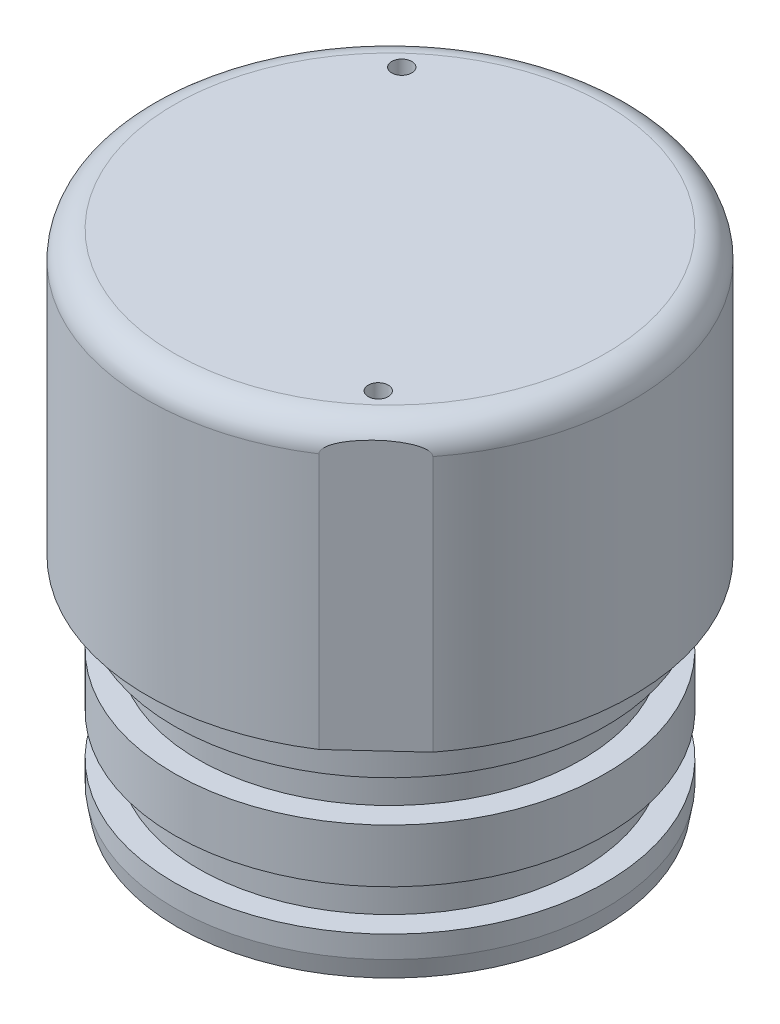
from build123d import *

# Parameters (mm, degrees)
SKETCH1_R                 = 25.4
BOSS_EXTRUDE1_DEPTH       = 25.4
SKETCH2_R                 = 28.575
BOSS_EXTRUDE2_DEPTH       = 33.3248
SKETCH6_R                 = 19.05
CUT_EXTRUDE3_DEPTH        = 50.8
CUT_EXTRUDE4_START        = -4.7498
SKETCH7_OUTSIDE_W         = 79.13
SKETCH7_OUTSIDE_H         = 79.13
SKETCH7_OUTSIDE_R         = 22.5806
CUT_EXTRUDE4_DEPTH        = 4.826
CUT_EXTRUDE6_START        = -15.875
SKETCH8_OUTSIDE_W         = 79.13
SKETCH8_OUTSIDE_H         = 79.13
SKETCH8_OUTSIDE_R         = 22.5806
CUT_EXTRUDE6_DEPTH        = 4.826
CHAMFER1_SIZE             = 0.381
CHAMFER1_SIZE2            = 2.160758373
SKETCH9_R                 = 11.1125
CUT_EXTRUDE7_DEPTH        = 53.379419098
FILLET1_R                 = 3.175
CUT_EXTRUDE8_DEPTH        = 72.285786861
CIRPATTERN1_COUNT         = 2
SKETCH11_R                = 1.1811
CUT_EXTRUDE9_DEPTH        = 9.525
F_4_40_TAPPED_HOLE1_D     = 2.2606
F_4_40_TAPPED_HOLE1_DEPTH = 3.175
F_4_40_TAPPED_HOLE1_TIP   = 0.679152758


with BuildPart() as part:
    # Sketch1 → Boss-Extrude1 (new body)
    with BuildSketch(Plane(origin=(0, 0, 0), x_dir=(1, 0, 0), z_dir=(0, 1, 0))):
        with Locations(Location((0, 0, 0), (0, 0, 270))):
            Circle(SKETCH1_R)
    extrude(amount=-BOSS_EXTRUDE1_DEPTH)

    # Sketch2 → Boss-Extrude2 (add)
    with BuildSketch(Plane(origin=(0, 0, 0), x_dir=(1, 0, 0), z_dir=(0, 1, 0))):
        with Locations(Location((0, 0, 0), (0, 0, 270))):
            Circle(SKETCH2_R)
    extrude(amount=BOSS_EXTRUDE2_DEPTH)

    # Sketch6 → Cut-Extrude3 (cut)
    with BuildSketch(Plane.XZ.offset(25.4)):
        with Locations(Location((0, 0, 0), (0, 0, 270))):
            Circle(SKETCH6_R)
    extrude(amount=-CUT_EXTRUDE3_DEPTH, mode=Mode.SUBTRACT)

    # Sketch7 outside → Cut-Extrude4 (cut)
    with BuildSketch(Plane.XZ.offset(25.4).offset(CUT_EXTRUDE4_START)):
        Rectangle(SKETCH7_OUTSIDE_W, SKETCH7_OUTSIDE_H)
        with Locations(Location((0, 0, 0), (0, 0, 270))):
            Circle(SKETCH7_OUTSIDE_R, mode=Mode.SUBTRACT)
    extrude(amount=-CUT_EXTRUDE4_DEPTH, mode=Mode.SUBTRACT)

    # Sketch8 outside → Cut-Extrude6 (cut)
    with BuildSketch(Plane.XZ.offset(25.4).offset(CUT_EXTRUDE6_START)):
        Rectangle(SKETCH8_OUTSIDE_W, SKETCH8_OUTSIDE_H)
        with Locations(Location((0, 0, 0), (0, 0, 270))):
            Circle(SKETCH8_OUTSIDE_R, mode=Mode.SUBTRACT)
    extrude(amount=-CUT_EXTRUDE6_DEPTH, mode=Mode.SUBTRACT)

    # Chamfer1
    chamfer1_edges = [part.edges().sort_by_distance(p)[0] for p in [
        (0, -25.4, -25.4),
    ]]
    chamfer1_side = [part.faces().sort_by_distance(p)[0] for p in [
        (0, -25.4, -24.68157951),
    ]]
    chamfer(chamfer1_edges, length=CHAMFER1_SIZE, length2=CHAMFER1_SIZE2, reference=chamfer1_side[0])

    # Sketch9 → Cut-Extrude7 (cut, through all)
    with BuildSketch(Plane.XY):
        with Locations(Location((0, 19.05, 0), (0, 0, 34.849904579))):
            Circle(SKETCH9_R)
    extrude(amount=-CUT_EXTRUDE7_DEPTH, mode=Mode.SUBTRACT)

    # Fillet1
    fillet1_edges = [part.edges().sort_by_distance(p)[0] for p in [
        (0, 33.3248, -28.575),
    ]]
    fillet(fillet1_edges, radius=FILLET1_R)

    # Sketch10 → Cut-Extrude8 (cut, symmetric)
    with BuildSketch(Plane(origin=(0, 33.3248, 0), x_dir=(1, 0, 0), z_dir=(0, 1, 0))):
        Polygon((131.296178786, 82.452579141), (22.566564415, -17.529426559), (15.579626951, -23.954244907), (-93.14998742, -123.936250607), (106.814023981, -341.395479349), (331.260190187, -135.0066496), align=None)
    cut_extrude8 = extrude(amount=CUT_EXTRUDE8_DEPTH, both=True, mode=Mode.SUBTRACT)

    # CirPattern1: Cut-Extrude8 ×2 about axis
    cirpattern1_axis = Axis((0, 33.3248, 0), (0, -1, 0))
    for i in range(1, CIRPATTERN1_COUNT):
        add(cut_extrude8.rotate(cirpattern1_axis, i * 360 / CIRPATTERN1_COUNT), mode=Mode.SUBTRACT)

    # Sketch11 → Cut-Extrude9 (cut)
    with BuildSketch(Plane(origin=(0, 33.3248, 0), x_dir=(1, 0, 0), z_dir=(0, 1, 0))):
        with Locations(Location((-15.81723766, 17.201116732, 0), (0, 0, 270))):
            Circle(SKETCH11_R)
        with Locations(Location((15.81723766, -17.201116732, 0), (0, 0, 270))):
            Circle(SKETCH11_R)
    extrude(amount=-CUT_EXTRUDE9_DEPTH, mode=Mode.SUBTRACT)

    # 4-40 Tapped Hole1
    with Locations(Plane(origin=(0, -25.4, 0), x_dir=(-1, 0, 0), z_dir=(0, -1, 0))):
        with Locations((14.562448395, 15.939359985), (15.939359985, -14.562448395), (-14.562448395, -15.939359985), (-15.939359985, 14.562448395)):
            Hole(F_4_40_TAPPED_HOLE1_D / 2, depth=F_4_40_TAPPED_HOLE1_DEPTH)
            with Locations((0, 0, -(F_4_40_TAPPED_HOLE1_DEPTH + F_4_40_TAPPED_HOLE1_TIP / 2))):  # 118° drill point
                Cone(0, F_4_40_TAPPED_HOLE1_D / 2, F_4_40_TAPPED_HOLE1_TIP, mode=Mode.SUBTRACT)


solid = part.part
